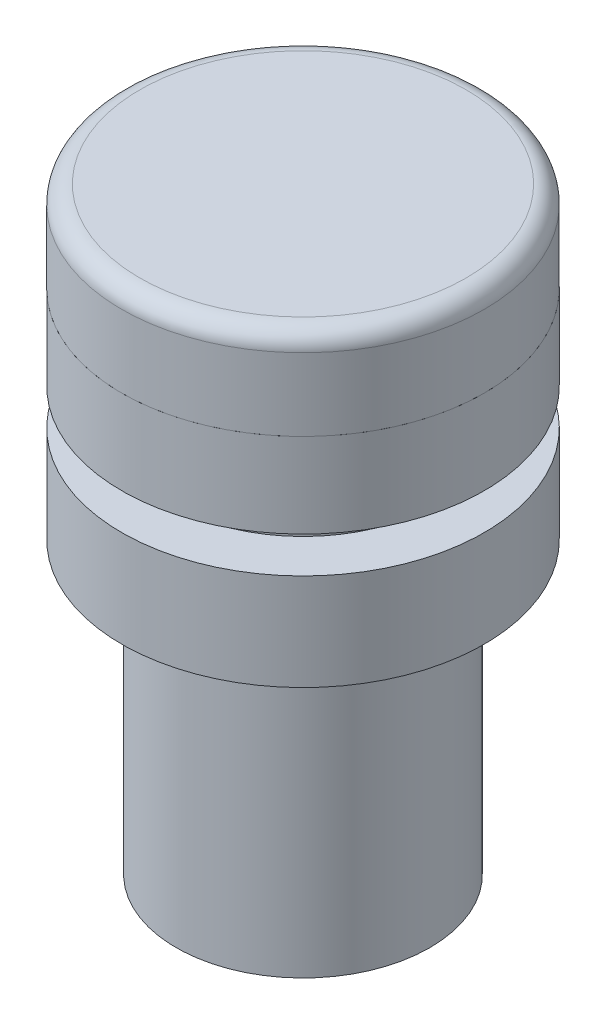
from build123d import *


with BuildPart() as part:
    # Esquisse1 → R_volution1 (revolve)
    with BuildSketch(Plane.XY):
        Polygon((0, 0), (0, -35), (-10.5, -35), (-10.5, -11), (-15, -11), (-15, -3), (-11, -3), (-11, 0), (-15, 0), (-15, 7), (0, 7), align=None)
        with BuildLine():
            Line((0, 7.1), (-13, 7.1))
            Line((-13, 7.1), (-13, 11.75))
            ThreePointArc((-13, 11.75), (-12.780330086, 12.280330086), (-12.25, 12.5))
            Line((-12.25, 12.5), (0, 12.5))
            Line((0, 12.5), (0, 7.1))
        make_face()
    revolve(axis=Axis((0, 0, 0), (0, -1, 0)))


with BuildPart() as body_2:
    # Esquisse2 → R_volution2 (revolve)
    with BuildSketch(Plane.XY, mode=Mode.PRIVATE) as r_volution2_sk:
        with BuildLine():
            Line((0, 12.5), (-12.25, 12.5))
            ThreePointArc((-12.25, 12.5), (-12.780330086, 12.280330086), (-13, 11.75))
            Line((-13, 11.75), (-13, 7.1))
            Line((-13, 7.1), (-13, 7))
            Line((-13, 7), (-15, 7))
            Line((-15, 7), (-15, 13))
            ThreePointArc((-15, 13), (-14.560660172, 14.060660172), (-13.5, 14.5))
            Line((-13.5, 14.5), (0, 14.5))
            Line((0, 14.5), (0, 12.5))
        make_face()
    revolve(r_volution2_sk.sketch.rotate(Axis((0, 12.5, 0), (0, 1, 0)), 180), axis=Axis((0, 12.5, 0), (0, 1, 0)))


solid = Compound([part.part, body_2.part])
